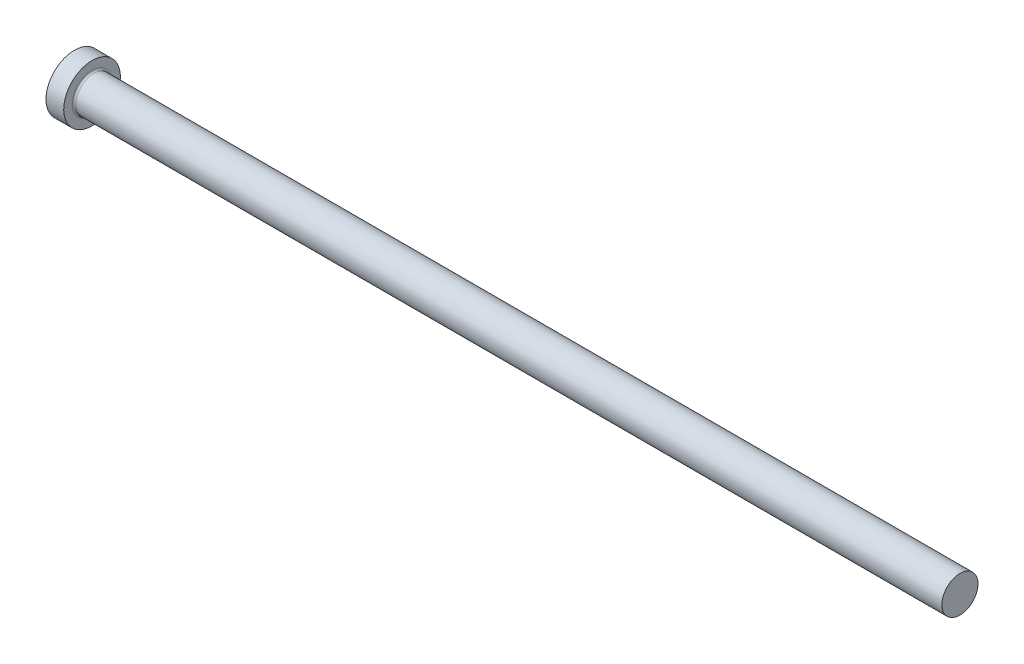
ISO-10303-21;
HEADER;
FILE_DESCRIPTION(('STEP AP214'),'2;1');
FILE_NAME('part.step','',(''),(''),'','','');
FILE_SCHEMA(('AUTOMOTIVE_DESIGN { 1 0 10303 214 1 1 1 1 }'));
ENDSEC;
DATA;
#1=APPLICATION_CONTEXT('core data for automotive mechanical design processes');
#2=APPLICATION_PROTOCOL_DEFINITION('international standard','automotive_design',2000,#1);
#3=PRODUCT_CONTEXT('',#1,'mechanical');
#4=PRODUCT('Part','Part','',(#3));
#5=PRODUCT_RELATED_PRODUCT_CATEGORY('part','',(#4));
#6=PRODUCT_DEFINITION_FORMATION('','',#4);
#7=PRODUCT_DEFINITION_CONTEXT('part definition',#1,'design');
#8=PRODUCT_DEFINITION('design','',#6,#7);
#9=PRODUCT_DEFINITION_SHAPE('','',#8);
#10=(LENGTH_UNIT() NAMED_UNIT(*) SI_UNIT(.MILLI.,.METRE.));
#11=(NAMED_UNIT(*) PLANE_ANGLE_UNIT() SI_UNIT($,.RADIAN.));
#12=(NAMED_UNIT(*) SI_UNIT($,.STERADIAN.) SOLID_ANGLE_UNIT());
#13=UNCERTAINTY_MEASURE_WITH_UNIT(LENGTH_MEASURE(1.E-05),#10,'distance_accuracy_value','');
#14=(GEOMETRIC_REPRESENTATION_CONTEXT(3) GLOBAL_UNCERTAINTY_ASSIGNED_CONTEXT((#13)) GLOBAL_UNIT_ASSIGNED_CONTEXT((#10,
#11,#12)) REPRESENTATION_CONTEXT('',''));
#15=CARTESIAN_POINT('',(0.,0.,0.));
#16=DIRECTION('',(0.,0.,1.));
#17=DIRECTION('',(1.,0.,0.));
#18=AXIS2_PLACEMENT_3D('',#15,#16,#17);
#19=CARTESIAN_POINT('',(0.,0.,0.));
#20=DIRECTION('',(-1.,0.,0.));
#21=DIRECTION('',(0.,-1.,0.));
#22=AXIS2_PLACEMENT_3D('',#19,#20,#21);
#23=PLANE('',#22);
#24=CARTESIAN_POINT('',(0.,0.,0.));
#25=DIRECTION('',(1.,0.,0.));
#26=DIRECTION('',(0.,1.,0.));
#27=AXIS2_PLACEMENT_3D('',#24,#25,#26);
#28=CIRCLE('',#27,8.);
#29=CARTESIAN_POINT('',(0.,8.,0.));
#30=VERTEX_POINT('',#29);
#31=EDGE_CURVE('E25',#30,#30,#28,.T.);
#32=ORIENTED_EDGE('',*,*,#31,.F.);
#33=EDGE_LOOP('',(#32));
#34=FACE_BOUND('',#33,.T.);
#35=ADVANCED_FACE('F14',(#34),#23,.T.);
#36=CARTESIAN_POINT('',(250.,0.,0.));
#37=DIRECTION('',(1.,0.,0.));
#38=DIRECTION('',(0.,1.,0.));
#39=AXIS2_PLACEMENT_3D('',#36,#37,#38);
#40=CYLINDRICAL_SURFACE('',#39,8.);
#41=ORIENTED_EDGE('',*,*,#31,.T.);
#42=EDGE_LOOP('',(#41));
#43=FACE_BOUND('',#42,.T.);
#44=CARTESIAN_POINT('',(5.,0.,0.));
#45=DIRECTION('',(1.,0.,0.));
#46=DIRECTION('',(0.,1.,0.));
#47=AXIS2_PLACEMENT_3D('',#44,#45,#46);
#48=CIRCLE('',#47,8.);
#49=CARTESIAN_POINT('',(5.,8.,0.));
#50=VERTEX_POINT('',#49);
#51=EDGE_CURVE('E29',#50,#50,#48,.T.);
#52=ORIENTED_EDGE('',*,*,#51,.F.);
#53=EDGE_LOOP('',(#52));
#54=FACE_BOUND('',#53,.T.);
#55=ADVANCED_FACE('F51',(#43,#54),#40,.T.);
#56=CARTESIAN_POINT('',(5.,8.,0.));
#57=DIRECTION('',(1.,0.,0.));
#58=DIRECTION('',(0.,1.,0.));
#59=AXIS2_PLACEMENT_3D('',#56,#57,#58);
#60=PLANE('',#59);
#61=CARTESIAN_POINT('',(5.,0.,0.));
#62=DIRECTION('',(1.,0.,0.));
#63=DIRECTION('',(0.,1.,0.));
#64=AXIS2_PLACEMENT_3D('',#61,#62,#63);
#65=CIRCLE('',#64,5.6);
#66=CARTESIAN_POINT('',(5.,5.6,0.));
#67=VERTEX_POINT('',#66);
#68=EDGE_CURVE('E9',#67,#67,#65,.F.);
#69=ORIENTED_EDGE('',*,*,#68,.T.);
#70=EDGE_LOOP('',(#69));
#71=FACE_BOUND('',#70,.T.);
#72=ORIENTED_EDGE('',*,*,#51,.T.);
#73=EDGE_LOOP('',(#72));
#74=FACE_BOUND('',#73,.T.);
#75=ADVANCED_FACE('F42',(#71,#74),#60,.T.);
#76=CARTESIAN_POINT('',(250.,0.,0.));
#77=DIRECTION('',(1.,0.,0.));
#78=DIRECTION('',(0.,1.,0.));
#79=AXIS2_PLACEMENT_3D('',#76,#77,#78);
#80=CYLINDRICAL_SURFACE('',#79,5.1);
#81=CARTESIAN_POINT('',(5.5,0.,0.));
#82=DIRECTION('',(1.,0.,0.));
#83=DIRECTION('',(0.,1.,0.));
#84=AXIS2_PLACEMENT_3D('',#81,#82,#83);
#85=CIRCLE('',#84,5.1);
#86=CARTESIAN_POINT('',(5.5,5.1,0.));
#87=VERTEX_POINT('',#86);
#88=EDGE_CURVE('E21',#87,#87,#85,.T.);
#89=ORIENTED_EDGE('',*,*,#88,.T.);
#90=EDGE_LOOP('',(#89));
#91=FACE_BOUND('',#90,.T.);
#92=CARTESIAN_POINT('',(250.,0.,0.));
#93=DIRECTION('',(1.,0.,0.));
#94=DIRECTION('',(0.,1.,0.));
#95=AXIS2_PLACEMENT_3D('',#92,#93,#94);
#96=CIRCLE('',#95,5.1);
#97=CARTESIAN_POINT('',(250.,5.10000000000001,0.));
#98=VERTEX_POINT('',#97);
#99=EDGE_CURVE('E34',#98,#98,#96,.T.);
#100=ORIENTED_EDGE('',*,*,#99,.F.);
#101=EDGE_LOOP('',(#100));
#102=FACE_BOUND('',#101,.T.);
#103=ADVANCED_FACE('F40',(#91,#102),#80,.T.);
#104=CARTESIAN_POINT('',(250.,5.1,0.));
#105=DIRECTION('',(1.,0.,0.));
#106=DIRECTION('',(0.,1.,0.));
#107=AXIS2_PLACEMENT_3D('',#104,#105,#106);
#108=PLANE('',#107);
#109=ORIENTED_EDGE('',*,*,#99,.T.);
#110=EDGE_LOOP('',(#109));
#111=FACE_BOUND('',#110,.T.);
#112=ADVANCED_FACE('F38',(#111),#108,.T.);
#113=CARTESIAN_POINT('',(5.5,0.,0.));
#114=DIRECTION('',(1.,0.,0.));
#115=DIRECTION('',(0.,1.,0.));
#116=AXIS2_PLACEMENT_3D('',#113,#114,#115);
#117=TOROIDAL_SURFACE('',#116,5.6,0.5);
#118=ORIENTED_EDGE('',*,*,#68,.F.);
#119=EDGE_LOOP('',(#118));
#120=FACE_BOUND('',#119,.T.);
#121=ORIENTED_EDGE('',*,*,#88,.F.);
#122=EDGE_LOOP('',(#121));
#123=FACE_BOUND('',#122,.T.);
#124=ADVANCED_FACE('F16',(#120,#123),#117,.F.);
#125=CLOSED_SHELL('',(#35,#55,#75,#103,#112,#124));
#126=MANIFOLD_SOLID_BREP('B1',#125);
#127=ADVANCED_BREP_SHAPE_REPRESENTATION('',(#18,#126),#14);
#128=SHAPE_DEFINITION_REPRESENTATION(#9,#127);
ENDSEC;
END-ISO-10303-21;
